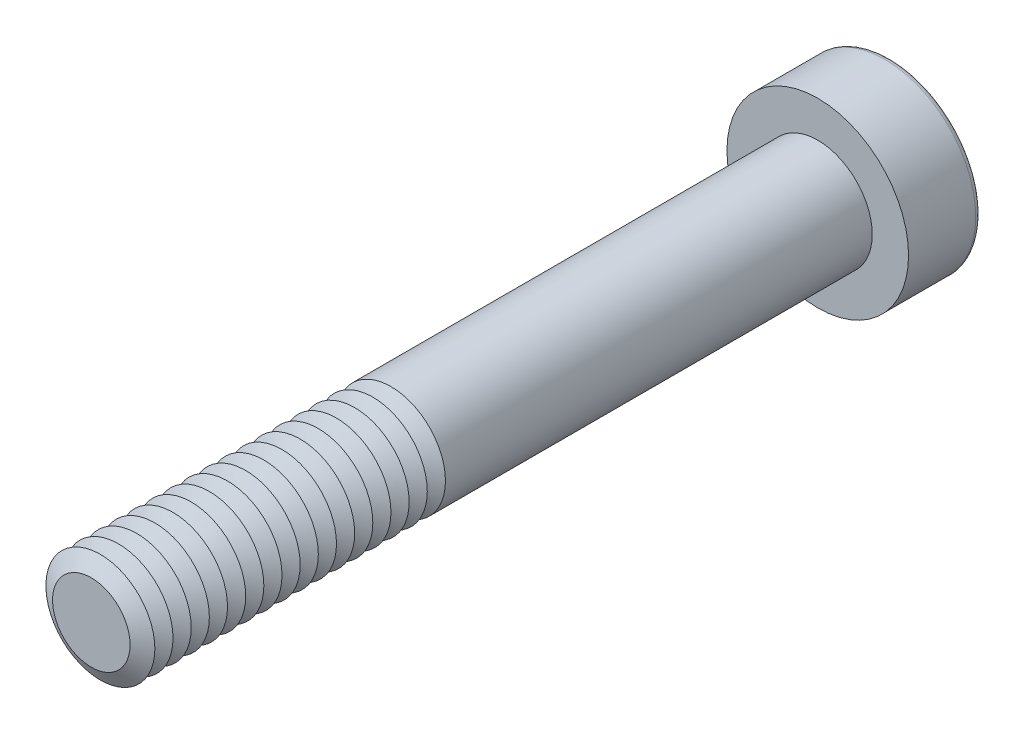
ISO-10303-21;
HEADER;
FILE_DESCRIPTION(('STEP AP214'),'2;1');
FILE_NAME('part.step','',(''),(''),'','','');
FILE_SCHEMA(('AUTOMOTIVE_DESIGN { 1 0 10303 214 1 1 1 1 }'));
ENDSEC;
DATA;
#1=APPLICATION_CONTEXT('core data for automotive mechanical design processes');
#2=APPLICATION_PROTOCOL_DEFINITION('international standard','automotive_design',2000,#1);
#3=PRODUCT_CONTEXT('',#1,'mechanical');
#4=PRODUCT('Part','Part','',(#3));
#5=PRODUCT_RELATED_PRODUCT_CATEGORY('part','',(#4));
#6=PRODUCT_DEFINITION_FORMATION('','',#4);
#7=PRODUCT_DEFINITION_CONTEXT('part definition',#1,'design');
#8=PRODUCT_DEFINITION('design','',#6,#7);
#9=PRODUCT_DEFINITION_SHAPE('','',#8);
#10=(LENGTH_UNIT() NAMED_UNIT(*) SI_UNIT(.MILLI.,.METRE.));
#11=(NAMED_UNIT(*) PLANE_ANGLE_UNIT() SI_UNIT($,.RADIAN.));
#12=(NAMED_UNIT(*) SI_UNIT($,.STERADIAN.) SOLID_ANGLE_UNIT());
#13=UNCERTAINTY_MEASURE_WITH_UNIT(LENGTH_MEASURE(1.E-05),#10,'distance_accuracy_value','');
#14=(GEOMETRIC_REPRESENTATION_CONTEXT(3) GLOBAL_UNCERTAINTY_ASSIGNED_CONTEXT((#13)) GLOBAL_UNIT_ASSIGNED_CONTEXT((#10,
#11,#12)) REPRESENTATION_CONTEXT('',''));
#15=CARTESIAN_POINT('',(0.,0.,0.));
#16=DIRECTION('',(0.,0.,1.));
#17=DIRECTION('',(1.,0.,0.));
#18=AXIS2_PLACEMENT_3D('',#15,#16,#17);
#19=CARTESIAN_POINT('',(0.,0.,36.5));
#20=DIRECTION('',(0.,0.,1.));
#21=DIRECTION('',(1.,0.,0.));
#22=AXIS2_PLACEMENT_3D('',#19,#20,#21);
#23=CONICAL_SURFACE('',#22,3.,1.0471975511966);
#24=CARTESIAN_POINT('',(0.,0.,36.));
#25=DIRECTION('',(0.,0.,1.));
#26=DIRECTION('',(1.,0.,0.));
#27=AXIS2_PLACEMENT_3D('',#24,#25,#26);
#28=CIRCLE('',#27,2.13397459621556);
#29=CARTESIAN_POINT('',(2.13397459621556,0.,36.));
#30=VERTEX_POINT('',#29);
#31=EDGE_CURVE('E314',#30,#30,#28,.T.);
#32=ORIENTED_EDGE('',*,*,#31,.T.);
#33=EDGE_LOOP('',(#32));
#34=FACE_BOUND('',#33,.T.);
#35=CARTESIAN_POINT('',(0.,0.,36.5));
#36=DIRECTION('',(0.,0.,1.));
#37=DIRECTION('',(1.,0.,0.));
#38=AXIS2_PLACEMENT_3D('',#35,#36,#37);
#39=CIRCLE('',#38,3.);
#40=CARTESIAN_POINT('',(3.,0.,36.5));
#41=VERTEX_POINT('',#40);
#42=EDGE_CURVE('E317',#41,#41,#39,.T.);
#43=ORIENTED_EDGE('',*,*,#42,.F.);
#44=EDGE_LOOP('',(#43));
#45=FACE_BOUND('',#44,.T.);
#46=ADVANCED_FACE('F39',(#34,#45),#23,.T.);
#47=CARTESIAN_POINT('',(0.,0.,36.));
#48=DIRECTION('',(0.,0.,-1.));
#49=DIRECTION('',(-1.,0.,0.));
#50=AXIS2_PLACEMENT_3D('',#47,#48,#49);
#51=CONICAL_SURFACE('',#50,2.13397459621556,1.0471975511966);
#52=CARTESIAN_POINT('',(0.,0.,35.5));
#53=DIRECTION('',(0.,0.,1.));
#54=DIRECTION('',(1.,0.,0.));
#55=AXIS2_PLACEMENT_3D('',#52,#53,#54);
#56=CIRCLE('',#55,3.);
#57=CARTESIAN_POINT('',(3.,0.,35.5));
#58=VERTEX_POINT('',#57);
#59=EDGE_CURVE('E325',#58,#58,#56,.T.);
#60=ORIENTED_EDGE('',*,*,#59,.T.);
#61=EDGE_LOOP('',(#60));
#62=FACE_BOUND('',#61,.T.);
#63=ORIENTED_EDGE('',*,*,#31,.F.);
#64=EDGE_LOOP('',(#63));
#65=FACE_BOUND('',#64,.T.);
#66=ADVANCED_FACE('F245',(#62,#65),#51,.T.);
#67=CARTESIAN_POINT('',(0.,0.,40.));
#68=DIRECTION('',(0.,0.,1.));
#69=DIRECTION('',(1.,0.,0.));
#70=AXIS2_PLACEMENT_3D('',#67,#68,#69);
#71=PLANE('',#70);
#72=CARTESIAN_POINT('',(0.,0.,40.));
#73=DIRECTION('',(0.,0.,1.));
#74=DIRECTION('',(1.,0.,0.));
#75=AXIS2_PLACEMENT_3D('',#72,#73,#74);
#76=CIRCLE('',#75,2.13397459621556);
#77=CARTESIAN_POINT('',(2.13397459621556,0.,40.));
#78=VERTEX_POINT('',#77);
#79=EDGE_CURVE('E174',#78,#78,#76,.T.);
#80=ORIENTED_EDGE('',*,*,#79,.T.);
#81=EDGE_LOOP('',(#80));
#82=FACE_BOUND('',#81,.T.);
#83=ADVANCED_FACE('F251',(#82),#71,.T.);
#84=CARTESIAN_POINT('',(0.,0.,40.));
#85=DIRECTION('',(0.,0.,-1.));
#86=DIRECTION('',(-1.,0.,0.));
#87=AXIS2_PLACEMENT_3D('',#84,#85,#86);
#88=CONICAL_SURFACE('',#87,2.13397459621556,1.0471975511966);
#89=CARTESIAN_POINT('',(0.,0.,39.5));
#90=DIRECTION('',(0.,0.,1.));
#91=DIRECTION('',(1.,0.,0.));
#92=AXIS2_PLACEMENT_3D('',#89,#90,#91);
#93=CIRCLE('',#92,3.);
#94=CARTESIAN_POINT('',(3.,0.,39.5));
#95=VERTEX_POINT('',#94);
#96=EDGE_CURVE('E291',#95,#95,#93,.T.);
#97=ORIENTED_EDGE('',*,*,#96,.T.);
#98=EDGE_LOOP('',(#97));
#99=FACE_BOUND('',#98,.T.);
#100=ORIENTED_EDGE('',*,*,#79,.F.);
#101=EDGE_LOOP('',(#100));
#102=FACE_BOUND('',#101,.T.);
#103=ADVANCED_FACE('F199',(#99,#102),#88,.T.);
#104=CARTESIAN_POINT('',(0.,0.,39.5));
#105=DIRECTION('',(0.,0.,1.));
#106=DIRECTION('',(1.,0.,0.));
#107=AXIS2_PLACEMENT_3D('',#104,#105,#106);
#108=CONICAL_SURFACE('',#107,3.,1.0471975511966);
#109=CARTESIAN_POINT('',(0.,0.,39.));
#110=DIRECTION('',(0.,0.,1.));
#111=DIRECTION('',(1.,0.,0.));
#112=AXIS2_PLACEMENT_3D('',#109,#110,#111);
#113=CIRCLE('',#112,2.13397459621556);
#114=CARTESIAN_POINT('',(2.13397459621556,0.,39.));
#115=VERTEX_POINT('',#114);
#116=EDGE_CURVE('E288',#115,#115,#113,.T.);
#117=ORIENTED_EDGE('',*,*,#116,.T.);
#118=EDGE_LOOP('',(#117));
#119=FACE_BOUND('',#118,.T.);
#120=ORIENTED_EDGE('',*,*,#96,.F.);
#121=EDGE_LOOP('',(#120));
#122=FACE_BOUND('',#121,.T.);
#123=ADVANCED_FACE('F277',(#119,#122),#108,.T.);
#124=CARTESIAN_POINT('',(0.,0.,39.));
#125=DIRECTION('',(0.,0.,-1.));
#126=DIRECTION('',(-1.,0.,0.));
#127=AXIS2_PLACEMENT_3D('',#124,#125,#126);
#128=CONICAL_SURFACE('',#127,2.13397459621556,1.0471975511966);
#129=CARTESIAN_POINT('',(0.,0.,38.5));
#130=DIRECTION('',(0.,0.,1.));
#131=DIRECTION('',(1.,0.,0.));
#132=AXIS2_PLACEMENT_3D('',#129,#130,#131);
#133=CIRCLE('',#132,3.);
#134=CARTESIAN_POINT('',(3.,0.,38.5));
#135=VERTEX_POINT('',#134);
#136=EDGE_CURVE('E300',#135,#135,#133,.T.);
#137=ORIENTED_EDGE('',*,*,#136,.T.);
#138=EDGE_LOOP('',(#137));
#139=FACE_BOUND('',#138,.T.);
#140=ORIENTED_EDGE('',*,*,#116,.F.);
#141=EDGE_LOOP('',(#140));
#142=FACE_BOUND('',#141,.T.);
#143=ADVANCED_FACE('F274',(#139,#142),#128,.T.);
#144=CARTESIAN_POINT('',(0.,0.,38.5));
#145=DIRECTION('',(0.,0.,1.));
#146=DIRECTION('',(1.,0.,0.));
#147=AXIS2_PLACEMENT_3D('',#144,#145,#146);
#148=CONICAL_SURFACE('',#147,3.,1.0471975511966);
#149=CARTESIAN_POINT('',(0.,0.,38.));
#150=DIRECTION('',(0.,0.,1.));
#151=DIRECTION('',(1.,0.,0.));
#152=AXIS2_PLACEMENT_3D('',#149,#150,#151);
#153=CIRCLE('',#152,2.13397459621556);
#154=CARTESIAN_POINT('',(2.13397459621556,0.,38.));
#155=VERTEX_POINT('',#154);
#156=EDGE_CURVE('E293',#155,#155,#153,.T.);
#157=ORIENTED_EDGE('',*,*,#156,.T.);
#158=EDGE_LOOP('',(#157));
#159=FACE_BOUND('',#158,.T.);
#160=ORIENTED_EDGE('',*,*,#136,.F.);
#161=EDGE_LOOP('',(#160));
#162=FACE_BOUND('',#161,.T.);
#163=ADVANCED_FACE('F270',(#159,#162),#148,.T.);
#164=CARTESIAN_POINT('',(0.,0.,38.));
#165=DIRECTION('',(0.,0.,-1.));
#166=DIRECTION('',(-1.,0.,0.));
#167=AXIS2_PLACEMENT_3D('',#164,#165,#166);
#168=CONICAL_SURFACE('',#167,2.13397459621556,1.0471975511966);
#169=CARTESIAN_POINT('',(0.,0.,37.5));
#170=DIRECTION('',(0.,0.,1.));
#171=DIRECTION('',(1.,0.,0.));
#172=AXIS2_PLACEMENT_3D('',#169,#170,#171);
#173=CIRCLE('',#172,3.);
#174=CARTESIAN_POINT('',(3.,0.,37.5));
#175=VERTEX_POINT('',#174);
#176=EDGE_CURVE('E310',#175,#175,#173,.T.);
#177=ORIENTED_EDGE('',*,*,#176,.T.);
#178=EDGE_LOOP('',(#177));
#179=FACE_BOUND('',#178,.T.);
#180=ORIENTED_EDGE('',*,*,#156,.F.);
#181=EDGE_LOOP('',(#180));
#182=FACE_BOUND('',#181,.T.);
#183=ADVANCED_FACE('F266',(#179,#182),#168,.T.);
#184=CARTESIAN_POINT('',(0.,0.,37.5));
#185=DIRECTION('',(0.,0.,1.));
#186=DIRECTION('',(1.,0.,0.));
#187=AXIS2_PLACEMENT_3D('',#184,#185,#186);
#188=CONICAL_SURFACE('',#187,3.,1.0471975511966);
#189=CARTESIAN_POINT('',(0.,0.,37.));
#190=DIRECTION('',(0.,0.,1.));
#191=DIRECTION('',(1.,0.,0.));
#192=AXIS2_PLACEMENT_3D('',#189,#190,#191);
#193=CIRCLE('',#192,2.13397459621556);
#194=CARTESIAN_POINT('',(2.13397459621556,0.,37.));
#195=VERTEX_POINT('',#194);
#196=EDGE_CURVE('E306',#195,#195,#193,.T.);
#197=ORIENTED_EDGE('',*,*,#196,.T.);
#198=EDGE_LOOP('',(#197));
#199=FACE_BOUND('',#198,.T.);
#200=ORIENTED_EDGE('',*,*,#176,.F.);
#201=EDGE_LOOP('',(#200));
#202=FACE_BOUND('',#201,.T.);
#203=ADVANCED_FACE('F262',(#199,#202),#188,.T.);
#204=CARTESIAN_POINT('',(0.,0.,37.));
#205=DIRECTION('',(0.,0.,-1.));
#206=DIRECTION('',(-1.,0.,0.));
#207=AXIS2_PLACEMENT_3D('',#204,#205,#206);
#208=CONICAL_SURFACE('',#207,2.13397459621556,1.0471975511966);
#209=ORIENTED_EDGE('',*,*,#42,.T.);
#210=EDGE_LOOP('',(#209));
#211=FACE_BOUND('',#210,.T.);
#212=ORIENTED_EDGE('',*,*,#196,.F.);
#213=EDGE_LOOP('',(#212));
#214=FACE_BOUND('',#213,.T.);
#215=ADVANCED_FACE('F258',(#211,#214),#208,.T.);
#216=CARTESIAN_POINT('',(0.,0.,35.5));
#217=DIRECTION('',(0.,0.,1.));
#218=DIRECTION('',(1.,0.,0.));
#219=AXIS2_PLACEMENT_3D('',#216,#217,#218);
#220=CONICAL_SURFACE('',#219,3.,1.0471975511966);
#221=CARTESIAN_POINT('',(0.,0.,35.));
#222=DIRECTION('',(0.,0.,1.));
#223=DIRECTION('',(1.,0.,0.));
#224=AXIS2_PLACEMENT_3D('',#221,#222,#223);
#225=CIRCLE('',#224,2.13397459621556);
#226=CARTESIAN_POINT('',(2.13397459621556,0.,35.));
#227=VERTEX_POINT('',#226);
#228=EDGE_CURVE('E321',#227,#227,#225,.T.);
#229=ORIENTED_EDGE('',*,*,#228,.T.);
#230=EDGE_LOOP('',(#229));
#231=FACE_BOUND('',#230,.T.);
#232=ORIENTED_EDGE('',*,*,#59,.F.);
#233=EDGE_LOOP('',(#232));
#234=FACE_BOUND('',#233,.T.);
#235=ADVANCED_FACE('F261',(#231,#234),#220,.T.);
#236=CARTESIAN_POINT('',(0.,0.,35.));
#237=DIRECTION('',(0.,0.,-1.));
#238=DIRECTION('',(-1.,0.,0.));
#239=AXIS2_PLACEMENT_3D('',#236,#237,#238);
#240=CONICAL_SURFACE('',#239,2.13397459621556,1.0471975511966);
#241=CARTESIAN_POINT('',(0.,0.,34.5));
#242=DIRECTION('',(0.,0.,1.));
#243=DIRECTION('',(1.,0.,0.));
#244=AXIS2_PLACEMENT_3D('',#241,#242,#243);
#245=CIRCLE('',#244,3.);
#246=CARTESIAN_POINT('',(3.,0.,34.5));
#247=VERTEX_POINT('',#246);
#248=EDGE_CURVE('E333',#247,#247,#245,.T.);
#249=ORIENTED_EDGE('',*,*,#248,.T.);
#250=EDGE_LOOP('',(#249));
#251=FACE_BOUND('',#250,.T.);
#252=ORIENTED_EDGE('',*,*,#228,.F.);
#253=EDGE_LOOP('',(#252));
#254=FACE_BOUND('',#253,.T.);
#255=ADVANCED_FACE('F510',(#251,#254),#240,.T.);
#256=CARTESIAN_POINT('',(0.,0.,34.5));
#257=DIRECTION('',(0.,0.,1.));
#258=DIRECTION('',(1.,0.,0.));
#259=AXIS2_PLACEMENT_3D('',#256,#257,#258);
#260=CONICAL_SURFACE('',#259,3.,1.0471975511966);
#261=CARTESIAN_POINT('',(0.,0.,34.));
#262=DIRECTION('',(0.,0.,1.));
#263=DIRECTION('',(1.,0.,0.));
#264=AXIS2_PLACEMENT_3D('',#261,#262,#263);
#265=CIRCLE('',#264,2.13397459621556);
#266=CARTESIAN_POINT('',(2.13397459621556,0.,34.));
#267=VERTEX_POINT('',#266);
#268=EDGE_CURVE('E329',#267,#267,#265,.T.);
#269=ORIENTED_EDGE('',*,*,#268,.T.);
#270=EDGE_LOOP('',(#269));
#271=FACE_BOUND('',#270,.T.);
#272=ORIENTED_EDGE('',*,*,#248,.F.);
#273=EDGE_LOOP('',(#272));
#274=FACE_BOUND('',#273,.T.);
#275=ADVANCED_FACE('F506',(#271,#274),#260,.T.);
#276=CARTESIAN_POINT('',(0.,0.,34.));
#277=DIRECTION('',(0.,0.,-1.));
#278=DIRECTION('',(-1.,0.,0.));
#279=AXIS2_PLACEMENT_3D('',#276,#277,#278);
#280=CONICAL_SURFACE('',#279,2.13397459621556,1.0471975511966);
#281=CARTESIAN_POINT('',(0.,0.,33.5));
#282=DIRECTION('',(0.,0.,1.));
#283=DIRECTION('',(1.,0.,0.));
#284=AXIS2_PLACEMENT_3D('',#281,#282,#283);
#285=CIRCLE('',#284,3.);
#286=CARTESIAN_POINT('',(3.,0.,33.5));
#287=VERTEX_POINT('',#286);
#288=EDGE_CURVE('E340',#287,#287,#285,.T.);
#289=ORIENTED_EDGE('',*,*,#288,.T.);
#290=EDGE_LOOP('',(#289));
#291=FACE_BOUND('',#290,.T.);
#292=ORIENTED_EDGE('',*,*,#268,.F.);
#293=EDGE_LOOP('',(#292));
#294=FACE_BOUND('',#293,.T.);
#295=ADVANCED_FACE('F502',(#291,#294),#280,.T.);
#296=CARTESIAN_POINT('',(0.,0.,33.5));
#297=DIRECTION('',(0.,0.,1.));
#298=DIRECTION('',(1.,0.,0.));
#299=AXIS2_PLACEMENT_3D('',#296,#297,#298);
#300=CONICAL_SURFACE('',#299,3.,1.0471975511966);
#301=CARTESIAN_POINT('',(0.,0.,33.));
#302=DIRECTION('',(0.,0.,1.));
#303=DIRECTION('',(1.,0.,0.));
#304=AXIS2_PLACEMENT_3D('',#301,#302,#303);
#305=CIRCLE('',#304,2.13397459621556);
#306=CARTESIAN_POINT('',(2.13397459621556,0.,33.));
#307=VERTEX_POINT('',#306);
#308=EDGE_CURVE('E337',#307,#307,#305,.T.);
#309=ORIENTED_EDGE('',*,*,#308,.T.);
#310=EDGE_LOOP('',(#309));
#311=FACE_BOUND('',#310,.T.);
#312=ORIENTED_EDGE('',*,*,#288,.F.);
#313=EDGE_LOOP('',(#312));
#314=FACE_BOUND('',#313,.T.);
#315=ADVANCED_FACE('F498',(#311,#314),#300,.T.);
#316=CARTESIAN_POINT('',(0.,0.,33.));
#317=DIRECTION('',(0.,0.,-1.));
#318=DIRECTION('',(-1.,0.,0.));
#319=AXIS2_PLACEMENT_3D('',#316,#317,#318);
#320=CONICAL_SURFACE('',#319,2.13397459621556,1.0471975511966);
#321=CARTESIAN_POINT('',(0.,0.,32.5));
#322=DIRECTION('',(0.,0.,1.));
#323=DIRECTION('',(1.,0.,0.));
#324=AXIS2_PLACEMENT_3D('',#321,#322,#323);
#325=CIRCLE('',#324,3.);
#326=CARTESIAN_POINT('',(3.,0.,32.5));
#327=VERTEX_POINT('',#326);
#328=EDGE_CURVE('E348',#327,#327,#325,.T.);
#329=ORIENTED_EDGE('',*,*,#328,.T.);
#330=EDGE_LOOP('',(#329));
#331=FACE_BOUND('',#330,.T.);
#332=ORIENTED_EDGE('',*,*,#308,.F.);
#333=EDGE_LOOP('',(#332));
#334=FACE_BOUND('',#333,.T.);
#335=ADVANCED_FACE('F494',(#331,#334),#320,.T.);
#336=CARTESIAN_POINT('',(0.,0.,32.5));
#337=DIRECTION('',(0.,0.,1.));
#338=DIRECTION('',(1.,0.,0.));
#339=AXIS2_PLACEMENT_3D('',#336,#337,#338);
#340=CONICAL_SURFACE('',#339,3.,1.0471975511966);
#341=CARTESIAN_POINT('',(0.,0.,32.));
#342=DIRECTION('',(0.,0.,1.));
#343=DIRECTION('',(1.,0.,0.));
#344=AXIS2_PLACEMENT_3D('',#341,#342,#343);
#345=CIRCLE('',#344,2.13397459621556);
#346=CARTESIAN_POINT('',(2.13397459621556,0.,32.));
#347=VERTEX_POINT('',#346);
#348=EDGE_CURVE('E344',#347,#347,#345,.T.);
#349=ORIENTED_EDGE('',*,*,#348,.T.);
#350=EDGE_LOOP('',(#349));
#351=FACE_BOUND('',#350,.T.);
#352=ORIENTED_EDGE('',*,*,#328,.F.);
#353=EDGE_LOOP('',(#352));
#354=FACE_BOUND('',#353,.T.);
#355=ADVANCED_FACE('F490',(#351,#354),#340,.T.);
#356=CARTESIAN_POINT('',(0.,0.,32.));
#357=DIRECTION('',(0.,0.,-1.));
#358=DIRECTION('',(-1.,0.,0.));
#359=AXIS2_PLACEMENT_3D('',#356,#357,#358);
#360=CONICAL_SURFACE('',#359,2.13397459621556,1.0471975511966);
#361=CARTESIAN_POINT('',(0.,0.,31.5));
#362=DIRECTION('',(0.,0.,1.));
#363=DIRECTION('',(1.,0.,0.));
#364=AXIS2_PLACEMENT_3D('',#361,#362,#363);
#365=CIRCLE('',#364,3.);
#366=CARTESIAN_POINT('',(3.,0.,31.5));
#367=VERTEX_POINT('',#366);
#368=EDGE_CURVE('E355',#367,#367,#365,.T.);
#369=ORIENTED_EDGE('',*,*,#368,.T.);
#370=EDGE_LOOP('',(#369));
#371=FACE_BOUND('',#370,.T.);
#372=ORIENTED_EDGE('',*,*,#348,.F.);
#373=EDGE_LOOP('',(#372));
#374=FACE_BOUND('',#373,.T.);
#375=ADVANCED_FACE('F486',(#371,#374),#360,.T.);
#376=CARTESIAN_POINT('',(0.,0.,31.5));
#377=DIRECTION('',(0.,0.,1.));
#378=DIRECTION('',(1.,0.,0.));
#379=AXIS2_PLACEMENT_3D('',#376,#377,#378);
#380=CONICAL_SURFACE('',#379,3.,1.0471975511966);
#381=CARTESIAN_POINT('',(0.,0.,31.));
#382=DIRECTION('',(0.,0.,1.));
#383=DIRECTION('',(1.,0.,0.));
#384=AXIS2_PLACEMENT_3D('',#381,#382,#383);
#385=CIRCLE('',#384,2.13397459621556);
#386=CARTESIAN_POINT('',(2.13397459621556,0.,31.));
#387=VERTEX_POINT('',#386);
#388=EDGE_CURVE('E351',#387,#387,#385,.T.);
#389=ORIENTED_EDGE('',*,*,#388,.T.);
#390=EDGE_LOOP('',(#389));
#391=FACE_BOUND('',#390,.T.);
#392=ORIENTED_EDGE('',*,*,#368,.F.);
#393=EDGE_LOOP('',(#392));
#394=FACE_BOUND('',#393,.T.);
#395=ADVANCED_FACE('F482',(#391,#394),#380,.T.);
#396=CARTESIAN_POINT('',(0.,0.,31.));
#397=DIRECTION('',(0.,0.,-1.));
#398=DIRECTION('',(-1.,0.,0.));
#399=AXIS2_PLACEMENT_3D('',#396,#397,#398);
#400=CONICAL_SURFACE('',#399,2.13397459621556,1.0471975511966);
#401=CARTESIAN_POINT('',(0.,0.,30.5));
#402=DIRECTION('',(0.,0.,1.));
#403=DIRECTION('',(1.,0.,0.));
#404=AXIS2_PLACEMENT_3D('',#401,#402,#403);
#405=CIRCLE('',#404,3.);
#406=CARTESIAN_POINT('',(3.,0.,30.5));
#407=VERTEX_POINT('',#406);
#408=EDGE_CURVE('E363',#407,#407,#405,.T.);
#409=ORIENTED_EDGE('',*,*,#408,.T.);
#410=EDGE_LOOP('',(#409));
#411=FACE_BOUND('',#410,.T.);
#412=ORIENTED_EDGE('',*,*,#388,.F.);
#413=EDGE_LOOP('',(#412));
#414=FACE_BOUND('',#413,.T.);
#415=ADVANCED_FACE('F478',(#411,#414),#400,.T.);
#416=CARTESIAN_POINT('',(0.,0.,30.5));
#417=DIRECTION('',(0.,0.,1.));
#418=DIRECTION('',(1.,0.,0.));
#419=AXIS2_PLACEMENT_3D('',#416,#417,#418);
#420=CONICAL_SURFACE('',#419,3.,1.0471975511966);
#421=CARTESIAN_POINT('',(0.,0.,30.));
#422=DIRECTION('',(0.,0.,1.));
#423=DIRECTION('',(1.,0.,0.));
#424=AXIS2_PLACEMENT_3D('',#421,#422,#423);
#425=CIRCLE('',#424,2.13397459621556);
#426=CARTESIAN_POINT('',(2.13397459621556,0.,30.));
#427=VERTEX_POINT('',#426);
#428=EDGE_CURVE('E359',#427,#427,#425,.T.);
#429=ORIENTED_EDGE('',*,*,#428,.T.);
#430=EDGE_LOOP('',(#429));
#431=FACE_BOUND('',#430,.T.);
#432=ORIENTED_EDGE('',*,*,#408,.F.);
#433=EDGE_LOOP('',(#432));
#434=FACE_BOUND('',#433,.T.);
#435=ADVANCED_FACE('F474',(#431,#434),#420,.T.);
#436=CARTESIAN_POINT('',(0.,0.,30.));
#437=DIRECTION('',(0.,0.,-1.));
#438=DIRECTION('',(-1.,0.,0.));
#439=AXIS2_PLACEMENT_3D('',#436,#437,#438);
#440=CONICAL_SURFACE('',#439,2.13397459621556,1.0471975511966);
#441=CARTESIAN_POINT('',(0.,0.,29.5));
#442=DIRECTION('',(0.,0.,1.));
#443=DIRECTION('',(1.,0.,0.));
#444=AXIS2_PLACEMENT_3D('',#441,#442,#443);
#445=CIRCLE('',#444,3.);
#446=CARTESIAN_POINT('',(3.,0.,29.5));
#447=VERTEX_POINT('',#446);
#448=EDGE_CURVE('E371',#447,#447,#445,.T.);
#449=ORIENTED_EDGE('',*,*,#448,.T.);
#450=EDGE_LOOP('',(#449));
#451=FACE_BOUND('',#450,.T.);
#452=ORIENTED_EDGE('',*,*,#428,.F.);
#453=EDGE_LOOP('',(#452));
#454=FACE_BOUND('',#453,.T.);
#455=ADVANCED_FACE('F470',(#451,#454),#440,.T.);
#456=CARTESIAN_POINT('',(0.,0.,29.5));
#457=DIRECTION('',(0.,0.,1.));
#458=DIRECTION('',(1.,0.,0.));
#459=AXIS2_PLACEMENT_3D('',#456,#457,#458);
#460=CONICAL_SURFACE('',#459,3.,1.0471975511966);
#461=CARTESIAN_POINT('',(0.,0.,29.));
#462=DIRECTION('',(0.,0.,1.));
#463=DIRECTION('',(1.,0.,0.));
#464=AXIS2_PLACEMENT_3D('',#461,#462,#463);
#465=CIRCLE('',#464,2.13397459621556);
#466=CARTESIAN_POINT('',(2.13397459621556,0.,29.));
#467=VERTEX_POINT('',#466);
#468=EDGE_CURVE('E367',#467,#467,#465,.T.);
#469=ORIENTED_EDGE('',*,*,#468,.T.);
#470=EDGE_LOOP('',(#469));
#471=FACE_BOUND('',#470,.T.);
#472=ORIENTED_EDGE('',*,*,#448,.F.);
#473=EDGE_LOOP('',(#472));
#474=FACE_BOUND('',#473,.T.);
#475=ADVANCED_FACE('F466',(#471,#474),#460,.T.);
#476=CARTESIAN_POINT('',(0.,0.,29.));
#477=DIRECTION('',(0.,0.,-1.));
#478=DIRECTION('',(-1.,0.,0.));
#479=AXIS2_PLACEMENT_3D('',#476,#477,#478);
#480=CONICAL_SURFACE('',#479,2.13397459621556,1.0471975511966);
#481=CARTESIAN_POINT('',(0.,0.,28.5));
#482=DIRECTION('',(0.,0.,1.));
#483=DIRECTION('',(1.,0.,0.));
#484=AXIS2_PLACEMENT_3D('',#481,#482,#483);
#485=CIRCLE('',#484,3.);
#486=CARTESIAN_POINT('',(3.,0.,28.5));
#487=VERTEX_POINT('',#486);
#488=EDGE_CURVE('E379',#487,#487,#485,.T.);
#489=ORIENTED_EDGE('',*,*,#488,.T.);
#490=EDGE_LOOP('',(#489));
#491=FACE_BOUND('',#490,.T.);
#492=ORIENTED_EDGE('',*,*,#468,.F.);
#493=EDGE_LOOP('',(#492));
#494=FACE_BOUND('',#493,.T.);
#495=ADVANCED_FACE('F462',(#491,#494),#480,.T.);
#496=CARTESIAN_POINT('',(0.,0.,28.5));
#497=DIRECTION('',(0.,0.,1.));
#498=DIRECTION('',(1.,0.,0.));
#499=AXIS2_PLACEMENT_3D('',#496,#497,#498);
#500=CONICAL_SURFACE('',#499,3.,1.0471975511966);
#501=CARTESIAN_POINT('',(0.,0.,28.));
#502=DIRECTION('',(0.,0.,1.));
#503=DIRECTION('',(1.,0.,0.));
#504=AXIS2_PLACEMENT_3D('',#501,#502,#503);
#505=CIRCLE('',#504,2.13397459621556);
#506=CARTESIAN_POINT('',(2.13397459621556,0.,28.));
#507=VERTEX_POINT('',#506);
#508=EDGE_CURVE('E375',#507,#507,#505,.T.);
#509=ORIENTED_EDGE('',*,*,#508,.T.);
#510=EDGE_LOOP('',(#509));
#511=FACE_BOUND('',#510,.T.);
#512=ORIENTED_EDGE('',*,*,#488,.F.);
#513=EDGE_LOOP('',(#512));
#514=FACE_BOUND('',#513,.T.);
#515=ADVANCED_FACE('F458',(#511,#514),#500,.T.);
#516=CARTESIAN_POINT('',(0.,0.,28.));
#517=DIRECTION('',(0.,0.,-1.));
#518=DIRECTION('',(-1.,0.,0.));
#519=AXIS2_PLACEMENT_3D('',#516,#517,#518);
#520=CONICAL_SURFACE('',#519,2.13397459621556,1.0471975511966);
#521=CARTESIAN_POINT('',(0.,0.,27.5));
#522=DIRECTION('',(0.,0.,1.));
#523=DIRECTION('',(1.,0.,0.));
#524=AXIS2_PLACEMENT_3D('',#521,#522,#523);
#525=CIRCLE('',#524,3.);
#526=CARTESIAN_POINT('',(3.,0.,27.5));
#527=VERTEX_POINT('',#526);
#528=EDGE_CURVE('E387',#527,#527,#525,.T.);
#529=ORIENTED_EDGE('',*,*,#528,.T.);
#530=EDGE_LOOP('',(#529));
#531=FACE_BOUND('',#530,.T.);
#532=ORIENTED_EDGE('',*,*,#508,.F.);
#533=EDGE_LOOP('',(#532));
#534=FACE_BOUND('',#533,.T.);
#535=ADVANCED_FACE('F454',(#531,#534),#520,.T.);
#536=CARTESIAN_POINT('',(0.,0.,27.5));
#537=DIRECTION('',(0.,0.,1.));
#538=DIRECTION('',(1.,0.,0.));
#539=AXIS2_PLACEMENT_3D('',#536,#537,#538);
#540=CONICAL_SURFACE('',#539,3.,1.0471975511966);
#541=CARTESIAN_POINT('',(0.,0.,27.));
#542=DIRECTION('',(0.,0.,1.));
#543=DIRECTION('',(1.,0.,0.));
#544=AXIS2_PLACEMENT_3D('',#541,#542,#543);
#545=CIRCLE('',#544,2.13397459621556);
#546=CARTESIAN_POINT('',(2.13397459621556,0.,27.));
#547=VERTEX_POINT('',#546);
#548=EDGE_CURVE('E383',#547,#547,#545,.T.);
#549=ORIENTED_EDGE('',*,*,#548,.T.);
#550=EDGE_LOOP('',(#549));
#551=FACE_BOUND('',#550,.T.);
#552=ORIENTED_EDGE('',*,*,#528,.F.);
#553=EDGE_LOOP('',(#552));
#554=FACE_BOUND('',#553,.T.);
#555=ADVANCED_FACE('F450',(#551,#554),#540,.T.);
#556=CARTESIAN_POINT('',(0.,0.,27.));
#557=DIRECTION('',(0.,0.,-1.));
#558=DIRECTION('',(-1.,0.,0.));
#559=AXIS2_PLACEMENT_3D('',#556,#557,#558);
#560=CONICAL_SURFACE('',#559,2.13397459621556,1.0471975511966);
#561=CARTESIAN_POINT('',(0.,0.,26.5));
#562=DIRECTION('',(0.,0.,1.));
#563=DIRECTION('',(1.,0.,0.));
#564=AXIS2_PLACEMENT_3D('',#561,#562,#563);
#565=CIRCLE('',#564,3.);
#566=CARTESIAN_POINT('',(3.,0.,26.5));
#567=VERTEX_POINT('',#566);
#568=EDGE_CURVE('E395',#567,#567,#565,.T.);
#569=ORIENTED_EDGE('',*,*,#568,.T.);
#570=EDGE_LOOP('',(#569));
#571=FACE_BOUND('',#570,.T.);
#572=ORIENTED_EDGE('',*,*,#548,.F.);
#573=EDGE_LOOP('',(#572));
#574=FACE_BOUND('',#573,.T.);
#575=ADVANCED_FACE('F446',(#571,#574),#560,.T.);
#576=CARTESIAN_POINT('',(0.,0.,26.5));
#577=DIRECTION('',(0.,0.,1.));
#578=DIRECTION('',(1.,0.,0.));
#579=AXIS2_PLACEMENT_3D('',#576,#577,#578);
#580=CONICAL_SURFACE('',#579,3.,1.0471975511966);
#581=CARTESIAN_POINT('',(0.,0.,26.));
#582=DIRECTION('',(0.,0.,1.));
#583=DIRECTION('',(1.,0.,0.));
#584=AXIS2_PLACEMENT_3D('',#581,#582,#583);
#585=CIRCLE('',#584,2.13397459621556);
#586=CARTESIAN_POINT('',(2.13397459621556,0.,26.));
#587=VERTEX_POINT('',#586);
#588=EDGE_CURVE('E391',#587,#587,#585,.T.);
#589=ORIENTED_EDGE('',*,*,#588,.T.);
#590=EDGE_LOOP('',(#589));
#591=FACE_BOUND('',#590,.T.);
#592=ORIENTED_EDGE('',*,*,#568,.F.);
#593=EDGE_LOOP('',(#592));
#594=FACE_BOUND('',#593,.T.);
#595=ADVANCED_FACE('F442',(#591,#594),#580,.T.);
#596=CARTESIAN_POINT('',(0.,0.,26.));
#597=DIRECTION('',(0.,0.,-1.));
#598=DIRECTION('',(-1.,0.,0.));
#599=AXIS2_PLACEMENT_3D('',#596,#597,#598);
#600=CONICAL_SURFACE('',#599,2.13397459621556,1.0471975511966);
#601=CARTESIAN_POINT('',(0.,0.,25.5));
#602=DIRECTION('',(0.,0.,1.));
#603=DIRECTION('',(1.,0.,0.));
#604=AXIS2_PLACEMENT_3D('',#601,#602,#603);
#605=CIRCLE('',#604,3.);
#606=CARTESIAN_POINT('',(3.,0.,25.5));
#607=VERTEX_POINT('',#606);
#608=EDGE_CURVE('E403',#607,#607,#605,.T.);
#609=ORIENTED_EDGE('',*,*,#608,.T.);
#610=EDGE_LOOP('',(#609));
#611=FACE_BOUND('',#610,.T.);
#612=ORIENTED_EDGE('',*,*,#588,.F.);
#613=EDGE_LOOP('',(#612));
#614=FACE_BOUND('',#613,.T.);
#615=ADVANCED_FACE('F438',(#611,#614),#600,.T.);
#616=CARTESIAN_POINT('',(0.,0.,25.5));
#617=DIRECTION('',(0.,0.,1.));
#618=DIRECTION('',(1.,0.,0.));
#619=AXIS2_PLACEMENT_3D('',#616,#617,#618);
#620=CONICAL_SURFACE('',#619,3.,1.0471975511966);
#621=CARTESIAN_POINT('',(0.,0.,25.));
#622=DIRECTION('',(0.,0.,1.));
#623=DIRECTION('',(1.,0.,0.));
#624=AXIS2_PLACEMENT_3D('',#621,#622,#623);
#625=CIRCLE('',#624,2.13397459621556);
#626=CARTESIAN_POINT('',(2.13397459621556,0.,25.));
#627=VERTEX_POINT('',#626);
#628=EDGE_CURVE('E399',#627,#627,#625,.T.);
#629=ORIENTED_EDGE('',*,*,#628,.T.);
#630=EDGE_LOOP('',(#629));
#631=FACE_BOUND('',#630,.T.);
#632=ORIENTED_EDGE('',*,*,#608,.F.);
#633=EDGE_LOOP('',(#632));
#634=FACE_BOUND('',#633,.T.);
#635=ADVANCED_FACE('F433',(#631,#634),#620,.T.);
#636=CARTESIAN_POINT('',(0.,0.,25.));
#637=DIRECTION('',(0.,0.,-1.));
#638=DIRECTION('',(-1.,0.,0.));
#639=AXIS2_PLACEMENT_3D('',#636,#637,#638);
#640=CONICAL_SURFACE('',#639,2.13397459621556,1.0471975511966);
#641=CARTESIAN_POINT('',(0.,0.,24.5));
#642=DIRECTION('',(0.,0.,1.));
#643=DIRECTION('',(1.,0.,0.));
#644=AXIS2_PLACEMENT_3D('',#641,#642,#643);
#645=CIRCLE('',#644,3.);
#646=CARTESIAN_POINT('',(3.,0.,24.5));
#647=VERTEX_POINT('',#646);
#648=EDGE_CURVE('E414',#647,#647,#645,.T.);
#649=ORIENTED_EDGE('',*,*,#648,.T.);
#650=EDGE_LOOP('',(#649));
#651=FACE_BOUND('',#650,.T.);
#652=ORIENTED_EDGE('',*,*,#628,.F.);
#653=EDGE_LOOP('',(#652));
#654=FACE_BOUND('',#653,.T.);
#655=ADVANCED_FACE('F419',(#651,#654),#640,.T.);
#656=CARTESIAN_POINT('',(0.,0.,24.5));
#657=DIRECTION('',(0.,0.,1.));
#658=DIRECTION('',(1.,0.,0.));
#659=AXIS2_PLACEMENT_3D('',#656,#657,#658);
#660=CONICAL_SURFACE('',#659,3.,1.0471975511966);
#661=CARTESIAN_POINT('',(0.,0.,24.));
#662=DIRECTION('',(0.,0.,1.));
#663=DIRECTION('',(1.,0.,0.));
#664=AXIS2_PLACEMENT_3D('',#661,#662,#663);
#665=CIRCLE('',#664,2.13397459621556);
#666=CARTESIAN_POINT('',(2.13397459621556,0.,24.));
#667=VERTEX_POINT('',#666);
#668=EDGE_CURVE('E407',#667,#667,#665,.T.);
#669=ORIENTED_EDGE('',*,*,#668,.T.);
#670=EDGE_LOOP('',(#669));
#671=FACE_BOUND('',#670,.T.);
#672=ORIENTED_EDGE('',*,*,#648,.F.);
#673=EDGE_LOOP('',(#672));
#674=FACE_BOUND('',#673,.T.);
#675=ADVANCED_FACE('F422',(#671,#674),#660,.T.);
#676=CARTESIAN_POINT('',(0.,0.,24.));
#677=DIRECTION('',(0.,0.,-1.));
#678=DIRECTION('',(-1.,0.,0.));
#679=AXIS2_PLACEMENT_3D('',#676,#677,#678);
#680=CONICAL_SURFACE('',#679,2.13397459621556,1.0471975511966);
#681=CARTESIAN_POINT('',(0.,0.,23.5));
#682=DIRECTION('',(0.,0.,1.));
#683=DIRECTION('',(1.,0.,0.));
#684=AXIS2_PLACEMENT_3D('',#681,#682,#683);
#685=CIRCLE('',#684,3.);
#686=CARTESIAN_POINT('',(3.,0.,23.5));
#687=VERTEX_POINT('',#686);
#688=EDGE_CURVE('E411',#687,#687,#685,.T.);
#689=ORIENTED_EDGE('',*,*,#688,.T.);
#690=EDGE_LOOP('',(#689));
#691=FACE_BOUND('',#690,.T.);
#692=ORIENTED_EDGE('',*,*,#668,.F.);
#693=EDGE_LOOP('',(#692));
#694=FACE_BOUND('',#693,.T.);
#695=ADVANCED_FACE('F424',(#691,#694),#680,.T.);
#696=CARTESIAN_POINT('',(0.,0.,-1.));
#697=DIRECTION('',(0.,0.,-1.));
#698=DIRECTION('',(-1.,0.,0.));
#699=AXIS2_PLACEMENT_3D('',#696,#697,#698);
#700=CONICAL_SURFACE('',#699,2.,1.0471975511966);
#701=CARTESIAN_POINT('',(0.,0.,0.154700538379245));
#702=VERTEX_POINT('',#701);
#703=VERTEX_LOOP('',#702);
#704=FACE_BOUND('',#703,.T.);
#705=CARTESIAN_POINT('',(0.,0.,-1.));
#706=DIRECTION('',(0.,0.,-1.));
#707=DIRECTION('',(-1.,0.,0.));
#708=AXIS2_PLACEMENT_3D('',#705,#706,#707);
#709=CIRCLE('',#708,2.);
#710=CARTESIAN_POINT('',(-1.73205080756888,0.999999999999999,-1.));
#711=VERTEX_POINT('',#710);
#712=CARTESIAN_POINT('',(0.,2.,-1.));
#713=VERTEX_POINT('',#712);
#714=EDGE_CURVE('E149',#711,#713,#709,.T.);
#715=ORIENTED_EDGE('',*,*,#714,.T.);
#716=CARTESIAN_POINT('',(0.,0.,-1.));
#717=DIRECTION('',(0.,0.,-1.));
#718=DIRECTION('',(-1.,0.,0.));
#719=AXIS2_PLACEMENT_3D('',#716,#717,#718);
#720=CIRCLE('',#719,2.);
#721=CARTESIAN_POINT('',(1.73205080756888,1.,-1.));
#722=VERTEX_POINT('',#721);
#723=EDGE_CURVE('E54',#713,#722,#720,.T.);
#724=ORIENTED_EDGE('',*,*,#723,.T.);
#725=CARTESIAN_POINT('',(1.73205080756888,-0.999999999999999,-1.));
#726=VERTEX_POINT('',#725);
#727=EDGE_CURVE('E1024',#722,#726,#720,.T.);
#728=ORIENTED_EDGE('',*,*,#727,.T.);
#729=CARTESIAN_POINT('',(0.,-2.,-1.));
#730=VERTEX_POINT('',#729);
#731=EDGE_CURVE('E1022',#726,#730,#720,.T.);
#732=ORIENTED_EDGE('',*,*,#731,.T.);
#733=CARTESIAN_POINT('',(-1.73205080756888,-0.999999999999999,-1.));
#734=VERTEX_POINT('',#733);
#735=EDGE_CURVE('E1016',#730,#734,#720,.T.);
#736=ORIENTED_EDGE('',*,*,#735,.T.);
#737=EDGE_CURVE('E1014',#734,#711,#720,.T.);
#738=ORIENTED_EDGE('',*,*,#737,.T.);
#739=EDGE_LOOP('',(#715,#724,#728,#732,#736,#738));
#740=FACE_BOUND('',#739,.T.);
#741=ADVANCED_FACE('F201',(#704,#740),#700,.F.);
#742=CARTESIAN_POINT('',(0.,0.,-1.));
#743=DIRECTION('',(0.,0.,-1.));
#744=DIRECTION('',(-1.,0.,0.));
#745=AXIS2_PLACEMENT_3D('',#742,#743,#744);
#746=PLANE('',#745);
#747=ORIENTED_EDGE('',*,*,#723,.F.);
#748=DIRECTION('',(1.,0.,0.));
#749=VECTOR('',#748,1.);
#750=CARTESIAN_POINT('',(-1.15470053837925,2.,-1.));
#751=LINE('',#750,#749);
#752=CARTESIAN_POINT('',(1.15470053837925,2.,-1.));
#753=VERTEX_POINT('',#752);
#754=EDGE_CURVE('E1064',#713,#753,#751,.T.);
#755=ORIENTED_EDGE('',*,*,#754,.T.);
#756=DIRECTION('',(0.5,-0.866025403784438,0.));
#757=VECTOR('',#756,1.);
#758=CARTESIAN_POINT('',(1.15470053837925,2.,-1.));
#759=LINE('',#758,#757);
#760=EDGE_CURVE('E155',#753,#722,#759,.T.);
#761=ORIENTED_EDGE('',*,*,#760,.T.);
#762=EDGE_LOOP('',(#747,#755,#761));
#763=FACE_BOUND('',#762,.T.);
#764=ADVANCED_FACE('F605',(#763),#746,.T.);
#765=ORIENTED_EDGE('',*,*,#727,.F.);
#766=CARTESIAN_POINT('',(2.3094010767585,0.,-1.));
#767=VERTEX_POINT('',#766);
#768=EDGE_CURVE('E1068',#722,#767,#759,.T.);
#769=ORIENTED_EDGE('',*,*,#768,.T.);
#770=DIRECTION('',(-0.5,-0.866025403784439,0.));
#771=VECTOR('',#770,1.);
#772=CARTESIAN_POINT('',(2.3094010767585,0.,-1.));
#773=LINE('',#772,#771);
#774=EDGE_CURVE('E1038',#767,#726,#773,.T.);
#775=ORIENTED_EDGE('',*,*,#774,.T.);
#776=EDGE_LOOP('',(#765,#769,#775));
#777=FACE_BOUND('',#776,.T.);
#778=ADVANCED_FACE('F615',(#777),#746,.T.);
#779=ORIENTED_EDGE('',*,*,#731,.F.);
#780=CARTESIAN_POINT('',(1.15470053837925,-2.,-1.));
#781=VERTEX_POINT('',#780);
#782=EDGE_CURVE('E1040',#726,#781,#773,.T.);
#783=ORIENTED_EDGE('',*,*,#782,.T.);
#784=DIRECTION('',(-1.,0.,0.));
#785=VECTOR('',#784,1.);
#786=CARTESIAN_POINT('',(1.15470053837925,-2.,-1.));
#787=LINE('',#786,#785);
#788=EDGE_CURVE('E990',#781,#730,#787,.T.);
#789=ORIENTED_EDGE('',*,*,#788,.T.);
#790=EDGE_LOOP('',(#779,#783,#789));
#791=FACE_BOUND('',#790,.T.);
#792=ADVANCED_FACE('F625',(#791),#746,.T.);
#793=ORIENTED_EDGE('',*,*,#735,.F.);
#794=CARTESIAN_POINT('',(-1.15470053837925,-2.,-1.));
#795=VERTEX_POINT('',#794);
#796=EDGE_CURVE('E1034',#730,#795,#787,.T.);
#797=ORIENTED_EDGE('',*,*,#796,.T.);
#798=DIRECTION('',(-0.5,0.866025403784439,0.));
#799=VECTOR('',#798,1.);
#800=CARTESIAN_POINT('',(-1.15470053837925,-2.,-1.));
#801=LINE('',#800,#799);
#802=EDGE_CURVE('E1036',#795,#734,#801,.T.);
#803=ORIENTED_EDGE('',*,*,#802,.T.);
#804=EDGE_LOOP('',(#793,#797,#803));
#805=FACE_BOUND('',#804,.T.);
#806=ADVANCED_FACE('F633',(#805),#746,.T.);
#807=ORIENTED_EDGE('',*,*,#737,.F.);
#808=CARTESIAN_POINT('',(-2.3094010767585,0.,-1.));
#809=VERTEX_POINT('',#808);
#810=EDGE_CURVE('E1042',#734,#809,#801,.T.);
#811=ORIENTED_EDGE('',*,*,#810,.T.);
#812=DIRECTION('',(0.5,0.866025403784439,0.));
#813=VECTOR('',#812,1.);
#814=CARTESIAN_POINT('',(-2.3094010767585,0.,-1.));
#815=LINE('',#814,#813);
#816=EDGE_CURVE('E158',#809,#711,#815,.T.);
#817=ORIENTED_EDGE('',*,*,#816,.T.);
#818=EDGE_LOOP('',(#807,#811,#817));
#819=FACE_BOUND('',#818,.T.);
#820=ADVANCED_FACE('F231',(#819),#746,.T.);
#821=ORIENTED_EDGE('',*,*,#714,.F.);
#822=CARTESIAN_POINT('',(-1.15470053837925,2.,-1.));
#823=VERTEX_POINT('',#822);
#824=EDGE_CURVE('E1049',#711,#823,#815,.T.);
#825=ORIENTED_EDGE('',*,*,#824,.T.);
#826=EDGE_CURVE('E1062',#823,#713,#751,.T.);
#827=ORIENTED_EDGE('',*,*,#826,.T.);
#828=EDGE_LOOP('',(#821,#825,#827));
#829=FACE_BOUND('',#828,.T.);
#830=ADVANCED_FACE('F617',(#829),#746,.T.);
#831=CARTESIAN_POINT('',(-1.15470053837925,2.,-1.));
#832=DIRECTION('',(0.,1.,0.));
#833=DIRECTION('',(0.,0.,1.));
#834=AXIS2_PLACEMENT_3D('',#831,#832,#833);
#835=PLANE('',#834);
#836=DIRECTION('',(0.,0.,-1.));
#837=VECTOR('',#836,1.);
#838=CARTESIAN_POINT('',(-1.15470053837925,2.,-1.));
#839=LINE('',#838,#837);
#840=CARTESIAN_POINT('',(-1.15470053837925,2.,-4.));
#841=VERTEX_POINT('',#840);
#842=EDGE_CURVE('E147',#823,#841,#839,.T.);
#843=ORIENTED_EDGE('',*,*,#842,.T.);
#844=CARTESIAN_POINT('',(-3.01440758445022,2.,-4.35051689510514));
#845=CARTESIAN_POINT('',(-2.92409762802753,2.,-4.33035636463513));
#846=CARTESIAN_POINT('',(-2.83373054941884,2.,-4.31045254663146));
#847=CARTESIAN_POINT('',(-2.65285291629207,2.,-4.27128852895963));
#848=CARTESIAN_POINT('',(-2.562342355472,2.,-4.25202835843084));
#849=CARTESIAN_POINT('',(-2.29037985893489,2.,-4.19537300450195));
#850=CARTESIAN_POINT('',(-2.10868043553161,2.,-4.15914446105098));
#851=CARTESIAN_POINT('',(-1.74597297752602,2.,-4.09171688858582));
#852=CARTESIAN_POINT('',(-1.56497266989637,2.,-4.06047686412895));
#853=CARTESIAN_POINT('',(-1.20186568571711,2.,-4.00513826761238));
#854=CARTESIAN_POINT('',(-1.01975924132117,2.,-3.98103824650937));
#855=CARTESIAN_POINT('',(-0.744747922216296,2.,-3.9525901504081));
#856=CARTESIAN_POINT('',(-0.652245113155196,2.,-3.9443671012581));
#857=CARTESIAN_POINT('',(-0.467020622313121,2.,-3.93099406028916));
#858=CARTESIAN_POINT('',(-0.374298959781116,2.,-3.92584380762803));
#859=CARTESIAN_POINT('',(-0.188764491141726,2.,-3.91891540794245));
#860=CARTESIAN_POINT('',(-0.0959517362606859,2.,-3.91713591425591));
#861=CARTESIAN_POINT('',(0.0896753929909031,2.,-3.91705786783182));
#862=CARTESIAN_POINT('',(0.182489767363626,2.,-3.91875932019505));
#863=CARTESIAN_POINT('',(0.368369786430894,2.,-3.92554892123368));
#864=CARTESIAN_POINT('',(0.461434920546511,2.,-3.93065079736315));
#865=CARTESIAN_POINT('',(0.647346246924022,2.,-3.94395663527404));
#866=CARTESIAN_POINT('',(0.740192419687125,2.,-3.95216086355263));
#867=CARTESIAN_POINT('',(1.01841374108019,2.,-3.98081777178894));
#868=CARTESIAN_POINT('',(1.2033713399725,2.,-4.00531018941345));
#869=CARTESIAN_POINT('',(1.57694396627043,2.,-4.06236202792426));
#870=CARTESIAN_POINT('',(1.76552771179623,2.,-4.09511615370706));
#871=CARTESIAN_POINT('',(2.14178491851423,2.,-4.1655706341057));
#872=CARTESIAN_POINT('',(2.32945822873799,2.,-4.20327178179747));
#873=CARTESIAN_POINT('',(2.70417911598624,2.,-4.28188312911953));
#874=CARTESIAN_POINT('',(2.89122649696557,2.,-4.32279425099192));
#875=CARTESIAN_POINT('',(3.26484478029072,2.,-4.40674298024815));
#876=CARTESIAN_POINT('',(3.45141567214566,2.,-4.44978063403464));
#877=CARTESIAN_POINT('',(3.821938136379,2.,-4.53678178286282));
#878=CARTESIAN_POINT('',(4.00589388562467,2.,-4.58072756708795));
#879=CARTESIAN_POINT('',(4.37356350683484,2.,-4.66963526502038));
#880=CARTESIAN_POINT('',(4.55727737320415,2.,-4.71459720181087));
#881=CARTESIAN_POINT('',(4.9242660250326,2.,-4.80519833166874));
#882=CARTESIAN_POINT('',(5.10754106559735,2.,-4.85083649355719));
#883=CARTESIAN_POINT('',(5.47394280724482,2.,-4.94267693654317));
#884=CARTESIAN_POINT('',(5.65706951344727,2.,-4.98887919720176));
#885=CARTESIAN_POINT('',(5.84014583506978,2.,-5.03527803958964));
#886=B_SPLINE_CURVE_WITH_KNOTS('',3,(#844,#845,#846,#847,#848,#849,#850,#851,#852,#853,#854,
#855,#856,#857,#858,#859,#860,#861,#862,#863,#864,#865,#866,#867,#868,#869,#870,#871,#872,#873,
#874,#875,#876,#877,#878,#879,#880,#881,#882,#883,#884,#885),.UNSPECIFIED.,.F.,.F.,(4,2,2,2,2,2,
2,2,2,2,2,2,2,2,2,2,2,2,2,2,4),(0.,0.277597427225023,0.555207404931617,1.11099118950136,
1.66194208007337,2.21278108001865,2.49134108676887,2.76987744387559,3.04830249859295,
3.32672796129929,3.60628428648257,3.88586463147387,4.44532615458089,5.0194589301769,
5.59368385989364,6.16807437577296,6.74247743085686,7.30986991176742,7.87727529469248,
8.44388991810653,9.01048407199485),.UNSPECIFIED.);
#887=CARTESIAN_POINT('',(1.15470053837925,2.,-4.));
#888=VERTEX_POINT('',#887);
#889=EDGE_CURVE('E124',#841,#888,#886,.T.);
#890=ORIENTED_EDGE('',*,*,#889,.T.);
#891=DIRECTION('',(0.,0.,-1.));
#892=VECTOR('',#891,1.);
#893=CARTESIAN_POINT('',(1.15470053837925,2.,-1.));
#894=LINE('',#893,#892);
#895=EDGE_CURVE('E143',#753,#888,#894,.T.);
#896=ORIENTED_EDGE('',*,*,#895,.F.);
#897=ORIENTED_EDGE('',*,*,#754,.F.);
#898=ORIENTED_EDGE('',*,*,#826,.F.);
#899=EDGE_LOOP('',(#843,#890,#896,#897,#898));
#900=FACE_BOUND('',#899,.T.);
#901=ADVANCED_FACE('F141',(#900),#835,.F.);
#902=CARTESIAN_POINT('',(1.15470053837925,2.,-1.));
#903=DIRECTION('',(0.866025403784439,0.5,0.));
#904=DIRECTION('',(-0.5,0.866025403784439,0.));
#905=AXIS2_PLACEMENT_3D('',#902,#903,#904);
#906=PLANE('',#905);
#907=ORIENTED_EDGE('',*,*,#895,.T.);
#908=CARTESIAN_POINT('',(1.15458506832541,2.0002,-4.00003094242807));
#909=CARTESIAN_POINT('',(1.20254643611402,1.91712847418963,-3.98717294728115));
#910=CARTESIAN_POINT('',(1.25059477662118,1.83390630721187,-3.97549990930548));
#911=CARTESIAN_POINT('',(1.3468611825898,1.66716800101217,-3.95499135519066));
#912=CARTESIAN_POINT('',(1.39507930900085,1.58365175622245,-3.94615699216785));
#913=CARTESIAN_POINT('',(1.49139287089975,1.41683177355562,-3.93184164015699));
#914=CARTESIAN_POINT('',(1.53948765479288,1.33352916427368,-3.92634357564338));
#915=CARTESIAN_POINT('',(1.63573857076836,1.1668176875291,-3.91897122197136));
#916=CARTESIAN_POINT('',(1.68389468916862,1.08340884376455,-3.91709623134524));
#917=CARTESIAN_POINT('',(1.78020692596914,0.916591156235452,-3.91709623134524));
#918=CARTESIAN_POINT('',(1.82836304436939,0.833182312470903,-3.91897122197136));
#919=CARTESIAN_POINT('',(1.92461396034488,0.666470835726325,-3.92634357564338));
#920=CARTESIAN_POINT('',(1.972708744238,0.583168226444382,-3.93184164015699));
#921=CARTESIAN_POINT('',(2.06902230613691,0.416348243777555,-3.94615699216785));
#922=CARTESIAN_POINT('',(2.11724043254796,0.332831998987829,-3.95499135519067));
#923=CARTESIAN_POINT('',(2.21350683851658,0.16609369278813,-3.97549990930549));
#924=CARTESIAN_POINT('',(2.26155517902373,0.0828715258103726,-3.98717294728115));
#925=CARTESIAN_POINT('',(2.30951654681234,-0.000199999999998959,-4.00003094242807));
#926=B_SPLINE_CURVE_WITH_KNOTS('',3,(#908,#909,#910,#911,#912,#913,#914,#915,#916,#917,#918,
#919,#920,#921,#922,#923,#924,#925),.UNSPECIFIED.,.F.,.F.,(4,2,2,2,2,2,2,2,4),(0.,
0.29035724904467,0.580832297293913,0.869807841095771,1.15872743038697,1.44764701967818,
1.73662256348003,2.02709761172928,2.31745486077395),.UNSPECIFIED.);
#927=CARTESIAN_POINT('',(2.3094010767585,0.,-4.));
#928=VERTEX_POINT('',#927);
#929=EDGE_CURVE('E11',#888,#928,#926,.T.);
#930=ORIENTED_EDGE('',*,*,#929,.T.);
#931=DIRECTION('',(0.,0.,-1.));
#932=VECTOR('',#931,1.);
#933=CARTESIAN_POINT('',(2.3094010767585,0.,-1.));
#934=LINE('',#933,#932);
#935=EDGE_CURVE('E157',#767,#928,#934,.T.);
#936=ORIENTED_EDGE('',*,*,#935,.F.);
#937=ORIENTED_EDGE('',*,*,#768,.F.);
#938=ORIENTED_EDGE('',*,*,#760,.F.);
#939=EDGE_LOOP('',(#907,#930,#936,#937,#938));
#940=FACE_BOUND('',#939,.T.);
#941=ADVANCED_FACE('F152',(#940),#906,.F.);
#942=CARTESIAN_POINT('',(2.3094010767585,0.,-1.));
#943=DIRECTION('',(0.866025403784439,-0.5,0.));
#944=DIRECTION('',(0.5,0.866025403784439,0.));
#945=AXIS2_PLACEMENT_3D('',#942,#943,#944);
#946=PLANE('',#945);
#947=ORIENTED_EDGE('',*,*,#935,.T.);
#948=CARTESIAN_POINT('',(2.30951654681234,0.000200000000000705,-4.00003094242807));
#949=CARTESIAN_POINT('',(2.26155517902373,-0.0828715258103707,-3.98717294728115));
#950=CARTESIAN_POINT('',(2.21350683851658,-0.166093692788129,-3.97549990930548));
#951=CARTESIAN_POINT('',(2.11724043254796,-0.332831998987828,-3.95499135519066));
#952=CARTESIAN_POINT('',(2.06902230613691,-0.416348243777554,-3.94615699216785));
#953=CARTESIAN_POINT('',(1.972708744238,-0.583168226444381,-3.93184164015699));
#954=CARTESIAN_POINT('',(1.92461396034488,-0.666470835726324,-3.92634357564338));
#955=CARTESIAN_POINT('',(1.82836304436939,-0.833182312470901,-3.91897122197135));
#956=CARTESIAN_POINT('',(1.78020692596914,-0.91659115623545,-3.91709623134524));
#957=CARTESIAN_POINT('',(1.68389468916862,-1.08340884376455,-3.91709623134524));
#958=CARTESIAN_POINT('',(1.63573857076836,-1.1668176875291,-3.91897122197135));
#959=CARTESIAN_POINT('',(1.53948765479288,-1.33352916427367,-3.92634357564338));
#960=CARTESIAN_POINT('',(1.49139287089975,-1.41683177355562,-3.93184164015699));
#961=CARTESIAN_POINT('',(1.39507930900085,-1.58365175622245,-3.94615699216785));
#962=CARTESIAN_POINT('',(1.3468611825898,-1.66716800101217,-3.95499135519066));
#963=CARTESIAN_POINT('',(1.25059477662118,-1.83390630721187,-3.97549990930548));
#964=CARTESIAN_POINT('',(1.20254643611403,-1.91712847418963,-3.98717294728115));
#965=CARTESIAN_POINT('',(1.15458506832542,-2.0002,-4.00003094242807));
#966=B_SPLINE_CURVE_WITH_KNOTS('',3,(#948,#949,#950,#951,#952,#953,#954,#955,#956,#957,#958,
#959,#960,#961,#962,#963,#964,#965),.UNSPECIFIED.,.F.,.F.,(4,2,2,2,2,2,2,2,4),(0.,
0.290357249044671,0.580832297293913,0.869807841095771,1.15872743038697,1.44764701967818,
1.73662256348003,2.02709761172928,2.31745486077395),.UNSPECIFIED.);
#967=CARTESIAN_POINT('',(1.15470053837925,-2.,-4.));
#968=VERTEX_POINT('',#967);
#969=EDGE_CURVE('E173',#928,#968,#966,.T.);
#970=ORIENTED_EDGE('',*,*,#969,.T.);
#971=DIRECTION('',(0.,0.,-1.));
#972=VECTOR('',#971,1.);
#973=CARTESIAN_POINT('',(1.15470053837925,-2.,-1.));
#974=LINE('',#973,#972);
#975=EDGE_CURVE('E985',#781,#968,#974,.T.);
#976=ORIENTED_EDGE('',*,*,#975,.F.);
#977=ORIENTED_EDGE('',*,*,#782,.F.);
#978=ORIENTED_EDGE('',*,*,#774,.F.);
#979=EDGE_LOOP('',(#947,#970,#976,#977,#978));
#980=FACE_BOUND('',#979,.T.);
#981=ADVANCED_FACE('F191',(#980),#946,.F.);
#982=CARTESIAN_POINT('',(1.15470053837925,-2.,-1.));
#983=DIRECTION('',(0.,-1.,0.));
#984=DIRECTION('',(0.,0.,-1.));
#985=AXIS2_PLACEMENT_3D('',#982,#983,#984);
#986=PLANE('',#985);
#987=ORIENTED_EDGE('',*,*,#975,.T.);
#988=CARTESIAN_POINT('',(-3.01440758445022,-2.,-4.35051689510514));
#989=CARTESIAN_POINT('',(-2.92409762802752,-2.,-4.33035636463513));
#990=CARTESIAN_POINT('',(-2.83373054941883,-2.,-4.31045254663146));
#991=CARTESIAN_POINT('',(-2.65285291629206,-2.,-4.27128852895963));
#992=CARTESIAN_POINT('',(-2.562342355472,-2.,-4.25202835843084));
#993=CARTESIAN_POINT('',(-2.29037985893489,-2.,-4.19537300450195));
#994=CARTESIAN_POINT('',(-2.10868043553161,-2.,-4.15914446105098));
#995=CARTESIAN_POINT('',(-1.74597297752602,-2.,-4.09171688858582));
#996=CARTESIAN_POINT('',(-1.56497266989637,-2.,-4.06047686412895));
#997=CARTESIAN_POINT('',(-1.20186568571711,-2.,-4.00513826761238));
#998=CARTESIAN_POINT('',(-1.01975924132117,-2.,-3.98103824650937));
#999=CARTESIAN_POINT('',(-0.744747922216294,-2.,-3.9525901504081));
#1000=CARTESIAN_POINT('',(-0.652245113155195,-2.,-3.9443671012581));
#1001=CARTESIAN_POINT('',(-0.46702062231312,-2.,-3.93099406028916));
#1002=CARTESIAN_POINT('',(-0.374298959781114,-2.,-3.92584380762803));
#1003=CARTESIAN_POINT('',(-0.188764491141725,-2.,-3.91891540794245));
#1004=CARTESIAN_POINT('',(-0.0959517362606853,-2.,-3.91713591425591));
#1005=CARTESIAN_POINT('',(0.0896753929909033,-2.,-3.91705786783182));
#1006=CARTESIAN_POINT('',(0.182489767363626,-2.,-3.91875932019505));
#1007=CARTESIAN_POINT('',(0.368369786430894,-2.,-3.92554892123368));
#1008=CARTESIAN_POINT('',(0.461434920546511,-2.,-3.93065079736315));
#1009=CARTESIAN_POINT('',(0.647346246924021,-2.,-3.94395663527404));
#1010=CARTESIAN_POINT('',(0.740192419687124,-2.,-3.95216086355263));
#1011=CARTESIAN_POINT('',(1.01841374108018,-2.,-3.98081777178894));
#1012=CARTESIAN_POINT('',(1.2033713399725,-2.,-4.00531018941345));
#1013=CARTESIAN_POINT('',(1.57694396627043,-2.,-4.06236202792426));
#1014=CARTESIAN_POINT('',(1.76552771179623,-2.,-4.09511615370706));
#1015=CARTESIAN_POINT('',(2.14178491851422,-2.,-4.1655706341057));
#1016=CARTESIAN_POINT('',(2.32945822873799,-2.,-4.20327178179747));
#1017=CARTESIAN_POINT('',(2.70417911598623,-2.,-4.28188312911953));
#1018=CARTESIAN_POINT('',(2.89122649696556,-2.,-4.32279425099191));
#1019=CARTESIAN_POINT('',(3.26484478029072,-2.,-4.40674298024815));
#1020=CARTESIAN_POINT('',(3.45141567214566,-2.,-4.44978063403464));
#1021=CARTESIAN_POINT('',(3.821938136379,-2.,-4.53678178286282));
#1022=CARTESIAN_POINT('',(4.00589388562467,-2.,-4.58072756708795));
#1023=CARTESIAN_POINT('',(4.37356350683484,-2.,-4.66963526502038));
#1024=CARTESIAN_POINT('',(4.55727737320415,-2.,-4.71459720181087));
#1025=CARTESIAN_POINT('',(4.9242660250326,-2.,-4.80519833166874));
#1026=CARTESIAN_POINT('',(5.10754106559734,-2.,-4.85083649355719));
#1027=CARTESIAN_POINT('',(5.47394280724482,-2.,-4.94267693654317));
#1028=CARTESIAN_POINT('',(5.65706951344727,-2.,-4.98887919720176));
#1029=CARTESIAN_POINT('',(5.84014583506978,-2.,-5.03527803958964));
#1030=B_SPLINE_CURVE_WITH_KNOTS('',3,(#988,#989,#990,#991,#992,#993,#994,#995,#996,#997,#998,
#999,#1000,#1001,#1002,#1003,#1004,#1005,#1006,#1007,#1008,#1009,#1010,#1011,#1012,#1013,#1014,
#1015,#1016,#1017,#1018,#1019,#1020,#1021,#1022,#1023,#1024,#1025,#1026,#1027,#1028,#1029),
.UNSPECIFIED.,.F.,.F.,(4,2,2,2,2,2,2,2,2,2,2,2,2,2,2,2,2,2,2,2,4),(0.,0.277597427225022,
0.555207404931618,1.11099118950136,1.66194208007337,2.21278108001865,2.49134108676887,
2.76987744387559,3.04830249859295,3.32672796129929,3.60628428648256,3.88586463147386,
4.44532615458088,5.01945893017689,5.59368385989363,6.16807437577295,6.74247743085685,
7.30986991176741,7.87727529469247,8.44388991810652,9.01048407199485),.UNSPECIFIED.);
#1031=CARTESIAN_POINT('',(-1.15470053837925,-2.,-4.));
#1032=VERTEX_POINT('',#1031);
#1033=EDGE_CURVE('E184',#968,#1032,#1030,.F.);
#1034=ORIENTED_EDGE('',*,*,#1033,.T.);
#1035=DIRECTION('',(0.,0.,-1.));
#1036=VECTOR('',#1035,1.);
#1037=CARTESIAN_POINT('',(-1.15470053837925,-2.,-1.));
#1038=LINE('',#1037,#1036);
#1039=EDGE_CURVE('E991',#795,#1032,#1038,.T.);
#1040=ORIENTED_EDGE('',*,*,#1039,.F.);
#1041=ORIENTED_EDGE('',*,*,#796,.F.);
#1042=ORIENTED_EDGE('',*,*,#788,.F.);
#1043=EDGE_LOOP('',(#987,#1034,#1040,#1041,#1042));
#1044=FACE_BOUND('',#1043,.T.);
#1045=ADVANCED_FACE('F234',(#1044),#986,.F.);
#1046=CARTESIAN_POINT('',(-1.15470053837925,-2.,-1.));
#1047=DIRECTION('',(-0.866025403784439,-0.5,0.));
#1048=DIRECTION('',(0.5,-0.866025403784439,0.));
#1049=AXIS2_PLACEMENT_3D('',#1046,#1047,#1048);
#1050=PLANE('',#1049);
#1051=ORIENTED_EDGE('',*,*,#1039,.T.);
#1052=CARTESIAN_POINT('',(-1.15458506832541,-2.0002,-4.00003094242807));
#1053=CARTESIAN_POINT('',(-1.20254643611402,-1.91712847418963,-3.98717294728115));
#1054=CARTESIAN_POINT('',(-1.25059477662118,-1.83390630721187,-3.97549990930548));
#1055=CARTESIAN_POINT('',(-1.34686118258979,-1.66716800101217,-3.95499135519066));
#1056=CARTESIAN_POINT('',(-1.39507930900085,-1.58365175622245,-3.94615699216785));
#1057=CARTESIAN_POINT('',(-1.49139287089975,-1.41683177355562,-3.93184164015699));
#1058=CARTESIAN_POINT('',(-1.53948765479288,-1.33352916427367,-3.92634357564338));
#1059=CARTESIAN_POINT('',(-1.63573857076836,-1.1668176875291,-3.91897122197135));
#1060=CARTESIAN_POINT('',(-1.68389468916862,-1.08340884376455,-3.91709623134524));
#1061=CARTESIAN_POINT('',(-1.78020692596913,-0.91659115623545,-3.91709623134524));
#1062=CARTESIAN_POINT('',(-1.82836304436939,-0.833182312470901,-3.91897122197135));
#1063=CARTESIAN_POINT('',(-1.92461396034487,-0.666470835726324,-3.92634357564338));
#1064=CARTESIAN_POINT('',(-1.972708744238,-0.583168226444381,-3.93184164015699));
#1065=CARTESIAN_POINT('',(-2.0690223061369,-0.416348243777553,-3.94615699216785));
#1066=CARTESIAN_POINT('',(-2.11724043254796,-0.332831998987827,-3.95499135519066));
#1067=CARTESIAN_POINT('',(-2.21350683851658,-0.166093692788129,-3.97549990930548));
#1068=CARTESIAN_POINT('',(-2.26155517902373,-0.0828715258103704,-3.98717294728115));
#1069=CARTESIAN_POINT('',(-2.30951654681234,0.000200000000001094,-4.00003094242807));
#1070=B_SPLINE_CURVE_WITH_KNOTS('',3,(#1052,#1053,#1054,#1055,#1056,#1057,#1058,#1059,#1060,
#1061,#1062,#1063,#1064,#1065,#1066,#1067,#1068,#1069),.UNSPECIFIED.,.F.,.F.,(4,2,2,2,2,2,2,2,
4),(0.,0.290357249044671,0.580832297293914,0.869807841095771,1.15872743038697,1.44764701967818,
1.73662256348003,2.02709761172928,2.31745486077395),.UNSPECIFIED.);
#1071=CARTESIAN_POINT('',(-2.3094010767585,0.,-4.));
#1072=VERTEX_POINT('',#1071);
#1073=EDGE_CURVE('E208',#1032,#1072,#1070,.T.);
#1074=ORIENTED_EDGE('',*,*,#1073,.T.);
#1075=DIRECTION('',(0.,0.,-1.));
#1076=VECTOR('',#1075,1.);
#1077=CARTESIAN_POINT('',(-2.3094010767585,0.,-1.));
#1078=LINE('',#1077,#1076);
#1079=EDGE_CURVE('E994',#809,#1072,#1078,.T.);
#1080=ORIENTED_EDGE('',*,*,#1079,.F.);
#1081=ORIENTED_EDGE('',*,*,#810,.F.);
#1082=ORIENTED_EDGE('',*,*,#802,.F.);
#1083=EDGE_LOOP('',(#1051,#1074,#1080,#1081,#1082));
#1084=FACE_BOUND('',#1083,.T.);
#1085=ADVANCED_FACE('F229',(#1084),#1050,.F.);
#1086=CARTESIAN_POINT('',(-2.3094010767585,0.,-1.));
#1087=DIRECTION('',(-0.866025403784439,0.5,0.));
#1088=DIRECTION('',(-0.5,-0.866025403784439,0.));
#1089=AXIS2_PLACEMENT_3D('',#1086,#1087,#1088);
#1090=PLANE('',#1089);
#1091=ORIENTED_EDGE('',*,*,#1079,.T.);
#1092=CARTESIAN_POINT('',(-2.30951654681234,-0.00019999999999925,-4.00003094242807));
#1093=CARTESIAN_POINT('',(-2.26155517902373,0.0828715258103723,-3.98717294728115));
#1094=CARTESIAN_POINT('',(-2.21350683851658,0.16609369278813,-3.97549990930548));
#1095=CARTESIAN_POINT('',(-2.11724043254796,0.332831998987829,-3.95499135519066));
#1096=CARTESIAN_POINT('',(-2.0690223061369,0.416348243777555,-3.94615699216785));
#1097=CARTESIAN_POINT('',(-1.972708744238,0.583168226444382,-3.93184164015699));
#1098=CARTESIAN_POINT('',(-1.92461396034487,0.666470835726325,-3.92634357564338));
#1099=CARTESIAN_POINT('',(-1.82836304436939,0.833182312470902,-3.91897122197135));
#1100=CARTESIAN_POINT('',(-1.78020692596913,0.916591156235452,-3.91709623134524));
#1101=CARTESIAN_POINT('',(-1.68389468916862,1.08340884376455,-3.91709623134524));
#1102=CARTESIAN_POINT('',(-1.63573857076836,1.1668176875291,-3.91897122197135));
#1103=CARTESIAN_POINT('',(-1.53948765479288,1.33352916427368,-3.92634357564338));
#1104=CARTESIAN_POINT('',(-1.49139287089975,1.41683177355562,-3.93184164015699));
#1105=CARTESIAN_POINT('',(-1.39507930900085,1.58365175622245,-3.94615699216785));
#1106=CARTESIAN_POINT('',(-1.3468611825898,1.66716800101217,-3.95499135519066));
#1107=CARTESIAN_POINT('',(-1.25059477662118,1.83390630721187,-3.97549990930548));
#1108=CARTESIAN_POINT('',(-1.20254643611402,1.91712847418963,-3.98717294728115));
#1109=CARTESIAN_POINT('',(-1.15458506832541,2.0002,-4.00003094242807));
#1110=B_SPLINE_CURVE_WITH_KNOTS('',3,(#1092,#1093,#1094,#1095,#1096,#1097,#1098,#1099,#1100,
#1101,#1102,#1103,#1104,#1105,#1106,#1107,#1108,#1109),.UNSPECIFIED.,.F.,.F.,(4,2,2,2,2,2,2,2,
4),(0.,0.29035724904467,0.580832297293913,0.869807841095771,1.15872743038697,1.44764701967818,
1.73662256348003,2.02709761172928,2.31745486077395),.UNSPECIFIED.);
#1111=EDGE_CURVE('E150',#1072,#841,#1110,.T.);
#1112=ORIENTED_EDGE('',*,*,#1111,.T.);
#1113=ORIENTED_EDGE('',*,*,#842,.F.);
#1114=ORIENTED_EDGE('',*,*,#824,.F.);
#1115=ORIENTED_EDGE('',*,*,#816,.F.);
#1116=EDGE_LOOP('',(#1091,#1112,#1113,#1114,#1115));
#1117=FACE_BOUND('',#1116,.T.);
#1118=ADVANCED_FACE('F197',(#1117),#1090,.F.);
#1119=CARTESIAN_POINT('',(0.,0.,-4.));
#1120=DIRECTION('',(0.,0.,-1.));
#1121=DIRECTION('',(-1.,0.,0.));
#1122=AXIS2_PLACEMENT_3D('',#1119,#1120,#1121);
#1123=CONICAL_SURFACE('',#1122,2.3094010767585,1.30899693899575);
#1124=CARTESIAN_POINT('',(0.,0.,-4.));
#1125=DIRECTION('',(0.,0.,-1.));
#1126=DIRECTION('',(-1.,0.,0.));
#1127=AXIS2_PLACEMENT_3D('',#1124,#1125,#1126);
#1128=CIRCLE('',#1127,2.3094010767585);
#1129=EDGE_CURVE('E120',#841,#888,#1128,.T.);
#1130=ORIENTED_EDGE('',*,*,#1129,.T.);
#1131=ORIENTED_EDGE('',*,*,#889,.F.);
#1132=EDGE_LOOP('',(#1130,#1131));
#1133=FACE_BOUND('',#1132,.T.);
#1134=ADVANCED_FACE('F122',(#1133),#1123,.F.);
#1135=EDGE_CURVE('E129',#888,#928,#1128,.T.);
#1136=ORIENTED_EDGE('',*,*,#1135,.T.);
#1137=ORIENTED_EDGE('',*,*,#929,.F.);
#1138=EDGE_LOOP('',(#1136,#1137));
#1139=FACE_BOUND('',#1138,.T.);
#1140=ADVANCED_FACE('F133',(#1139),#1123,.F.);
#1141=EDGE_CURVE('E164',#928,#968,#1128,.T.);
#1142=ORIENTED_EDGE('',*,*,#1141,.T.);
#1143=ORIENTED_EDGE('',*,*,#969,.F.);
#1144=EDGE_LOOP('',(#1142,#1143));
#1145=FACE_BOUND('',#1144,.T.);
#1146=ADVANCED_FACE('F698',(#1145),#1123,.F.);
#1147=EDGE_CURVE('E169',#968,#1032,#1128,.T.);
#1148=ORIENTED_EDGE('',*,*,#1147,.T.);
#1149=ORIENTED_EDGE('',*,*,#1033,.F.);
#1150=EDGE_LOOP('',(#1148,#1149));
#1151=FACE_BOUND('',#1150,.T.);
#1152=ADVANCED_FACE('F705',(#1151),#1123,.F.);
#1153=EDGE_CURVE('E67',#1032,#1072,#1128,.T.);
#1154=ORIENTED_EDGE('',*,*,#1153,.T.);
#1155=ORIENTED_EDGE('',*,*,#1073,.F.);
#1156=EDGE_LOOP('',(#1154,#1155));
#1157=FACE_BOUND('',#1156,.T.);
#1158=ADVANCED_FACE('F713',(#1157),#1123,.F.);
#1159=EDGE_CURVE('E60',#1072,#841,#1128,.T.);
#1160=ORIENTED_EDGE('',*,*,#1159,.T.);
#1161=ORIENTED_EDGE('',*,*,#1111,.F.);
#1162=EDGE_LOOP('',(#1160,#1161));
#1163=FACE_BOUND('',#1162,.T.);
#1164=ADVANCED_FACE('F198',(#1163),#1123,.F.);
#1165=CARTESIAN_POINT('',(0.,0.,-4.));
#1166=DIRECTION('',(0.,0.,-1.));
#1167=DIRECTION('',(-1.,0.,0.));
#1168=AXIS2_PLACEMENT_3D('',#1165,#1166,#1167);
#1169=PLANE('',#1168);
#1170=ORIENTED_EDGE('',*,*,#1159,.F.);
#1171=ORIENTED_EDGE('',*,*,#1153,.F.);
#1172=ORIENTED_EDGE('',*,*,#1147,.F.);
#1173=ORIENTED_EDGE('',*,*,#1141,.F.);
#1174=ORIENTED_EDGE('',*,*,#1135,.F.);
#1175=ORIENTED_EDGE('',*,*,#1129,.F.);
#1176=EDGE_LOOP('',(#1170,#1171,#1172,#1173,#1174,#1175));
#1177=FACE_BOUND('',#1176,.T.);
#1178=CARTESIAN_POINT('',(0.,0.,-4.));
#1179=DIRECTION('',(0.,0.,-1.));
#1180=DIRECTION('',(-1.,0.,0.));
#1181=AXIS2_PLACEMENT_3D('',#1178,#1179,#1180);
#1182=CIRCLE('',#1181,4.7);
#1183=CARTESIAN_POINT('',(-4.7,0.,-4.));
#1184=VERTEX_POINT('',#1183);
#1185=EDGE_CURVE('E1008',#1184,#1184,#1182,.T.);
#1186=ORIENTED_EDGE('',*,*,#1185,.T.);
#1187=EDGE_LOOP('',(#1186));
#1188=FACE_BOUND('',#1187,.T.);
#1189=ADVANCED_FACE('F161',(#1177,#1188),#1169,.T.);
#1190=CARTESIAN_POINT('',(0.,0.,-3.7));
#1191=DIRECTION('',(0.,0.,-1.));
#1192=DIRECTION('',(-1.,0.,0.));
#1193=AXIS2_PLACEMENT_3D('',#1190,#1191,#1192);
#1194=TOROIDAL_SURFACE('',#1193,4.7,0.3);
#1195=CARTESIAN_POINT('',(0.,0.,-3.7));
#1196=DIRECTION('',(0.,0.,-1.));
#1197=DIRECTION('',(-1.,0.,0.));
#1198=AXIS2_PLACEMENT_3D('',#1195,#1196,#1197);
#1199=CIRCLE('',#1198,5.);
#1200=CARTESIAN_POINT('',(-5.,0.,-3.7));
#1201=VERTEX_POINT('',#1200);
#1202=EDGE_CURVE('E1012',#1201,#1201,#1199,.F.);
#1203=ORIENTED_EDGE('',*,*,#1202,.F.);
#1204=EDGE_LOOP('',(#1203));
#1205=FACE_BOUND('',#1204,.T.);
#1206=ORIENTED_EDGE('',*,*,#1185,.F.);
#1207=EDGE_LOOP('',(#1206));
#1208=FACE_BOUND('',#1207,.T.);
#1209=ADVANCED_FACE('F41',(#1205,#1208),#1194,.T.);
#1210=CARTESIAN_POINT('',(0.,0.,-4.));
#1211=DIRECTION('',(0.,0.,1.));
#1212=DIRECTION('',(1.,0.,0.));
#1213=AXIS2_PLACEMENT_3D('',#1210,#1211,#1212);
#1214=CYLINDRICAL_SURFACE('',#1213,5.);
#1215=ORIENTED_EDGE('',*,*,#1202,.T.);
#1216=EDGE_LOOP('',(#1215));
#1217=FACE_BOUND('',#1216,.T.);
#1218=CARTESIAN_POINT('',(0.,0.,0.));
#1219=DIRECTION('',(0.,0.,-1.));
#1220=DIRECTION('',(-1.,0.,0.));
#1221=AXIS2_PLACEMENT_3D('',#1218,#1219,#1220);
#1222=CIRCLE('',#1221,5.);
#1223=CARTESIAN_POINT('',(-5.,0.,0.));
#1224=VERTEX_POINT('',#1223);
#1225=EDGE_CURVE('E1000',#1224,#1224,#1222,.T.);
#1226=ORIENTED_EDGE('',*,*,#1225,.T.);
#1227=EDGE_LOOP('',(#1226));
#1228=FACE_BOUND('',#1227,.T.);
#1229=ADVANCED_FACE('F737',(#1217,#1228),#1214,.T.);
#1230=CARTESIAN_POINT('',(0.,0.,0.));
#1231=DIRECTION('',(0.,0.,-1.));
#1232=DIRECTION('',(-1.,0.,0.));
#1233=AXIS2_PLACEMENT_3D('',#1230,#1231,#1232);
#1234=PLANE('',#1233);
#1235=CARTESIAN_POINT('',(0.,0.,0.));
#1236=DIRECTION('',(0.,0.,1.));
#1237=DIRECTION('',(1.,0.,0.));
#1238=AXIS2_PLACEMENT_3D('',#1235,#1236,#1237);
#1239=CIRCLE('',#1238,3.);
#1240=CARTESIAN_POINT('',(3.,0.,0.));
#1241=VERTEX_POINT('',#1240);
#1242=EDGE_CURVE('E1004',#1241,#1241,#1239,.T.);
#1243=ORIENTED_EDGE('',*,*,#1242,.F.);
#1244=EDGE_LOOP('',(#1243));
#1245=FACE_BOUND('',#1244,.T.);
#1246=ORIENTED_EDGE('',*,*,#1225,.F.);
#1247=EDGE_LOOP('',(#1246));
#1248=FACE_BOUND('',#1247,.T.);
#1249=ADVANCED_FACE('F745',(#1245,#1248),#1234,.F.);
#1250=CARTESIAN_POINT('',(0.,0.,40.));
#1251=DIRECTION('',(0.,0.,-1.));
#1252=DIRECTION('',(-1.,0.,0.));
#1253=AXIS2_PLACEMENT_3D('',#1250,#1251,#1252);
#1254=CYLINDRICAL_SURFACE('',#1253,3.);
#1255=ORIENTED_EDGE('',*,*,#1242,.T.);
#1256=EDGE_LOOP('',(#1255));
#1257=FACE_BOUND('',#1256,.T.);
#1258=ORIENTED_EDGE('',*,*,#688,.F.);
#1259=EDGE_LOOP('',(#1258));
#1260=FACE_BOUND('',#1259,.T.);
#1261=ADVANCED_FACE('F754',(#1257,#1260),#1254,.T.);
#1262=CLOSED_SHELL('',(#46,#66,#83,#103,#123,#143,#163,#183,#203,#215,#235,#255,#275,#295,#315,
#335,#355,#375,#395,#415,#435,#455,#475,#495,#515,#535,#555,#575,#595,#615,#635,#655,#675,#695,
#741,#764,#778,#792,#806,#820,#830,#901,#941,#981,#1045,#1085,#1118,#1134,#1140,#1146,#1152,
#1158,#1164,#1189,#1209,#1229,#1249,#1261));
#1263=MANIFOLD_SOLID_BREP('B2',#1262);
#1264=ADVANCED_BREP_SHAPE_REPRESENTATION('',(#18,#1263),#14);
#1265=SHAPE_DEFINITION_REPRESENTATION(#9,#1264);
ENDSEC;
END-ISO-10303-21;
